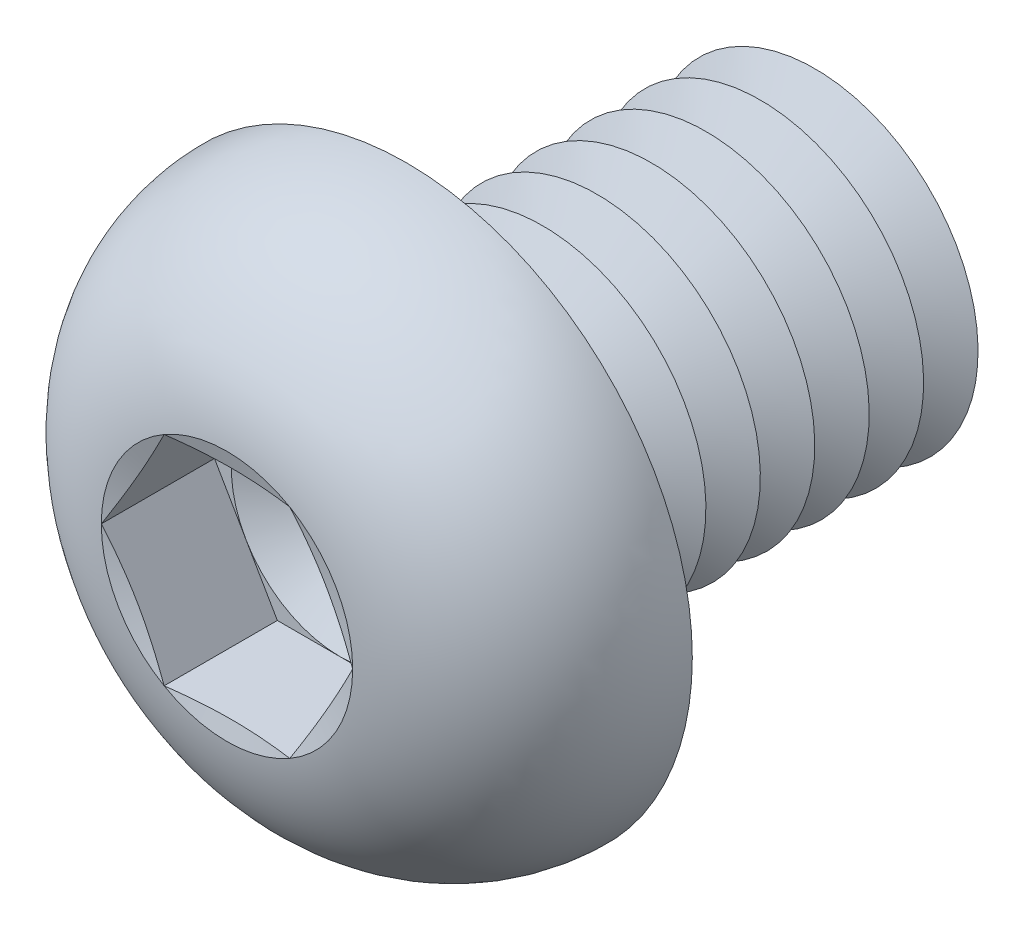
ISO-10303-21;
HEADER;
FILE_DESCRIPTION(('STEP AP214'),'2;1');
FILE_NAME('part.step','',(''),(''),'','','');
FILE_SCHEMA(('AUTOMOTIVE_DESIGN { 1 0 10303 214 1 1 1 1 }'));
ENDSEC;
DATA;
#1=APPLICATION_CONTEXT('core data for automotive mechanical design processes');
#2=APPLICATION_PROTOCOL_DEFINITION('international standard','automotive_design',2000,#1);
#3=PRODUCT_CONTEXT('',#1,'mechanical');
#4=PRODUCT('Part','Part','',(#3));
#5=PRODUCT_RELATED_PRODUCT_CATEGORY('part','',(#4));
#6=PRODUCT_DEFINITION_FORMATION('','',#4);
#7=PRODUCT_DEFINITION_CONTEXT('part definition',#1,'design');
#8=PRODUCT_DEFINITION('design','',#6,#7);
#9=PRODUCT_DEFINITION_SHAPE('','',#8);
#10=(LENGTH_UNIT() NAMED_UNIT(*) SI_UNIT(.MILLI.,.METRE.));
#11=(NAMED_UNIT(*) PLANE_ANGLE_UNIT() SI_UNIT($,.RADIAN.));
#12=(NAMED_UNIT(*) SI_UNIT($,.STERADIAN.) SOLID_ANGLE_UNIT());
#13=UNCERTAINTY_MEASURE_WITH_UNIT(LENGTH_MEASURE(1.E-05),#10,'distance_accuracy_value','');
#14=(GEOMETRIC_REPRESENTATION_CONTEXT(3) GLOBAL_UNCERTAINTY_ASSIGNED_CONTEXT((#13)) GLOBAL_UNIT_ASSIGNED_CONTEXT((#10,
#11,#12)) REPRESENTATION_CONTEXT('',''));
#15=CARTESIAN_POINT('',(0.,0.,0.));
#16=DIRECTION('',(0.,0.,1.));
#17=DIRECTION('',(1.,0.,0.));
#18=AXIS2_PLACEMENT_3D('',#15,#16,#17);
#19=CARTESIAN_POINT('',(0.,0.,1.22));
#20=DIRECTION('',(0.,0.,1.));
#21=DIRECTION('',(1.,0.,0.));
#22=AXIS2_PLACEMENT_3D('',#19,#20,#21);
#23=PLANE('',#22);
#24=CARTESIAN_POINT('',(0.,0.,1.22));
#25=DIRECTION('',(0.,0.,1.));
#26=DIRECTION('',(1.,0.,0.));
#27=AXIS2_PLACEMENT_3D('',#24,#25,#26);
#28=CIRCLE('',#27,1.99999906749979);
#29=CARTESIAN_POINT('',(1.73205,0.999999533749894,1.22));
#30=VERTEX_POINT('',#29);
#31=CARTESIAN_POINT('',(0.,1.99999906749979,1.22));
#32=VERTEX_POINT('',#31);
#33=EDGE_CURVE('E118',#30,#32,#28,.T.);
#34=ORIENTED_EDGE('',*,*,#33,.F.);
#35=DIRECTION('',(-0.5,0.866025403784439,0.));
#36=VECTOR('',#35,1.);
#37=CARTESIAN_POINT('',(2.30940000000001,0.,1.22));
#38=LINE('',#37,#36);
#39=CARTESIAN_POINT('',(1.1547,1.99999906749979,1.22));
#40=VERTEX_POINT('',#39);
#41=EDGE_CURVE('E125',#30,#40,#38,.T.);
#42=ORIENTED_EDGE('',*,*,#41,.T.);
#43=DIRECTION('',(-1.,0.,0.));
#44=VECTOR('',#43,1.);
#45=CARTESIAN_POINT('',(1.1547,1.99999906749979,1.22));
#46=LINE('',#45,#44);
#47=EDGE_CURVE('E136',#40,#32,#46,.T.);
#48=ORIENTED_EDGE('',*,*,#47,.T.);
#49=EDGE_LOOP('',(#34,#42,#48));
#50=FACE_BOUND('',#49,.T.);
#51=ADVANCED_FACE('F39',(#50),#23,.T.);
#52=CARTESIAN_POINT('',(0.,0.,1.22));
#53=DIRECTION('',(0.,0.,1.));
#54=DIRECTION('',(1.,0.,0.));
#55=AXIS2_PLACEMENT_3D('',#52,#53,#54);
#56=CIRCLE('',#55,1.99999906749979);
#57=CARTESIAN_POINT('',(-1.73205,0.999999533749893,1.22));
#58=VERTEX_POINT('',#57);
#59=EDGE_CURVE('E11',#32,#58,#56,.T.);
#60=ORIENTED_EDGE('',*,*,#59,.F.);
#61=CARTESIAN_POINT('',(-1.1547,1.99999906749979,1.22));
#62=VERTEX_POINT('',#61);
#63=EDGE_CURVE('E131',#32,#62,#46,.T.);
#64=ORIENTED_EDGE('',*,*,#63,.T.);
#65=DIRECTION('',(-0.5,-0.866025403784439,0.));
#66=VECTOR('',#65,1.);
#67=CARTESIAN_POINT('',(-1.1547,1.99999906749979,1.22));
#68=LINE('',#67,#66);
#69=EDGE_CURVE('E134',#62,#58,#68,.T.);
#70=ORIENTED_EDGE('',*,*,#69,.T.);
#71=EDGE_LOOP('',(#60,#64,#70));
#72=FACE_BOUND('',#71,.T.);
#73=ADVANCED_FACE('F130',(#72),#23,.T.);
#74=CARTESIAN_POINT('',(-1.73205,-0.999999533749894,1.22));
#75=VERTEX_POINT('',#74);
#76=EDGE_CURVE('E49',#58,#75,#56,.T.);
#77=ORIENTED_EDGE('',*,*,#76,.F.);
#78=CARTESIAN_POINT('',(-2.30940000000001,0.,1.22));
#79=VERTEX_POINT('',#78);
#80=EDGE_CURVE('E143',#58,#79,#68,.T.);
#81=ORIENTED_EDGE('',*,*,#80,.T.);
#82=DIRECTION('',(0.5,-0.866025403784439,0.));
#83=VECTOR('',#82,1.);
#84=CARTESIAN_POINT('',(-2.30940000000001,0.,1.22));
#85=LINE('',#84,#83);
#86=EDGE_CURVE('E152',#79,#75,#85,.T.);
#87=ORIENTED_EDGE('',*,*,#86,.T.);
#88=EDGE_LOOP('',(#77,#81,#87));
#89=FACE_BOUND('',#88,.T.);
#90=ADVANCED_FACE('F332',(#89),#23,.T.);
#91=CARTESIAN_POINT('',(0.,-1.99999906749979,1.22));
#92=VERTEX_POINT('',#91);
#93=EDGE_CURVE('E315',#75,#92,#56,.T.);
#94=ORIENTED_EDGE('',*,*,#93,.F.);
#95=CARTESIAN_POINT('',(-1.1547,-1.99999906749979,1.22));
#96=VERTEX_POINT('',#95);
#97=EDGE_CURVE('E151',#75,#96,#85,.T.);
#98=ORIENTED_EDGE('',*,*,#97,.T.);
#99=DIRECTION('',(1.,0.,0.));
#100=VECTOR('',#99,1.);
#101=CARTESIAN_POINT('',(-1.1547,-1.99999906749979,1.22));
#102=LINE('',#101,#100);
#103=EDGE_CURVE('E157',#96,#92,#102,.T.);
#104=ORIENTED_EDGE('',*,*,#103,.T.);
#105=EDGE_LOOP('',(#94,#98,#104));
#106=FACE_BOUND('',#105,.T.);
#107=ADVANCED_FACE('F326',(#106),#23,.T.);
#108=CARTESIAN_POINT('',(1.73205000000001,-0.999999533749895,1.22));
#109=VERTEX_POINT('',#108);
#110=EDGE_CURVE('E56',#92,#109,#56,.T.);
#111=ORIENTED_EDGE('',*,*,#110,.F.);
#112=CARTESIAN_POINT('',(1.1547,-1.99999906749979,1.22));
#113=VERTEX_POINT('',#112);
#114=EDGE_CURVE('E156',#92,#113,#102,.T.);
#115=ORIENTED_EDGE('',*,*,#114,.T.);
#116=DIRECTION('',(0.5,0.866025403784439,0.));
#117=VECTOR('',#116,1.);
#118=CARTESIAN_POINT('',(1.1547,-1.99999906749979,1.22));
#119=LINE('',#118,#117);
#120=EDGE_CURVE('E162',#113,#109,#119,.T.);
#121=ORIENTED_EDGE('',*,*,#120,.T.);
#122=EDGE_LOOP('',(#111,#115,#121));
#123=FACE_BOUND('',#122,.T.);
#124=ADVANCED_FACE('F400',(#123),#23,.T.);
#125=CARTESIAN_POINT('',(0.,0.,3.3));
#126=DIRECTION('',(0.,0.,1.));
#127=DIRECTION('',(0.,-1.,0.));
#128=AXIS2_PLACEMENT_3D('',#125,#126,#127);
#129=CONICAL_SURFACE('',#128,2.30940000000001,1.30899693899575);
#130=CARTESIAN_POINT('',(2.30951547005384,-0.000200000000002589,3.30003094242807));
#131=CARTESIAN_POINT('',(2.26155412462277,0.0828714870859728,3.2871729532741));
#132=CARTESIAN_POINT('',(2.2135058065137,0.166093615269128,3.27549992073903));
#133=CARTESIAN_POINT('',(2.11723944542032,0.332831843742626,3.2549913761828));
#134=CARTESIAN_POINT('',(2.06902134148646,0.416348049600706,3.24615701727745));
#135=CARTESIAN_POINT('',(1.97270782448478,0.583167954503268,3.23184167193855));
#136=CARTESIAN_POINT('',(1.92461306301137,0.666470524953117,3.22634360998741));
#137=CARTESIAN_POINT('',(1.82836219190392,0.833181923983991,3.21897125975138));
#138=CARTESIAN_POINT('',(1.78020609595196,0.916590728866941,3.21709626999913));
#139=CARTESIAN_POINT('',(1.68389390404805,1.08340833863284,3.21709626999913));
#140=CARTESIAN_POINT('',(1.63573780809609,1.16681714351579,3.21897125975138));
#141=CARTESIAN_POINT('',(1.53948693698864,1.33352854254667,3.22634360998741));
#142=CARTESIAN_POINT('',(1.49139217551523,1.41683111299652,3.23184167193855));
#143=CARTESIAN_POINT('',(1.39507865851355,1.58365101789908,3.24615701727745));
#144=CARTESIAN_POINT('',(1.34686055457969,1.66716722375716,3.2549913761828));
#145=CARTESIAN_POINT('',(1.25059419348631,1.83390545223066,3.27549992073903));
#146=CARTESIAN_POINT('',(1.20254587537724,1.91712758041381,3.2871729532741));
#147=CARTESIAN_POINT('',(1.15458452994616,2.00019906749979,3.30003094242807));
#148=B_SPLINE_CURVE_WITH_KNOTS('',3,(#130,#131,#132,#133,#134,#135,#136,#137,#138,#139,#140,
#141,#142,#143,#144,#145,#146,#147),.UNSPECIFIED.,.F.,.F.,(4,2,2,2,2,2,2,2,4),(0.,
0.29035711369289,0.580832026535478,0.86980743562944,1.15872689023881,1.44764634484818,
1.73662175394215,2.02709666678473,2.31745378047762),.UNSPECIFIED.);
#149=CARTESIAN_POINT('',(2.30940000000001,0.,3.3));
#150=VERTEX_POINT('',#149);
#151=CARTESIAN_POINT('',(1.15469999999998,1.9999990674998,3.3));
#152=VERTEX_POINT('',#151);
#153=EDGE_CURVE('E221',#150,#152,#148,.T.);
#154=ORIENTED_EDGE('',*,*,#153,.F.);
#155=CARTESIAN_POINT('',(0.,0.,3.3));
#156=DIRECTION('',(0.,0.,-1.));
#157=DIRECTION('',(0.,1.,0.));
#158=AXIS2_PLACEMENT_3D('',#155,#156,#157);
#159=CIRCLE('',#158,2.30940000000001);
#160=EDGE_CURVE('E300',#152,#150,#159,.T.);
#161=ORIENTED_EDGE('',*,*,#160,.F.);
#162=EDGE_LOOP('',(#154,#161));
#163=FACE_BOUND('',#162,.T.);
#164=ADVANCED_FACE('F404',(#163),#129,.F.);
#165=CARTESIAN_POINT('',(1.15458452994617,-2.00019906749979,3.30003094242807));
#166=CARTESIAN_POINT('',(1.20254587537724,-1.91712758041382,3.2871729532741));
#167=CARTESIAN_POINT('',(1.25059419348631,-1.83390545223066,3.27549992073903));
#168=CARTESIAN_POINT('',(1.34686055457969,-1.66716722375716,3.2549913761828));
#169=CARTESIAN_POINT('',(1.39507865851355,-1.58365101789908,3.24615701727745));
#170=CARTESIAN_POINT('',(1.49139217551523,-1.41683111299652,3.23184167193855));
#171=CARTESIAN_POINT('',(1.53948693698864,-1.33352854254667,3.22634360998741));
#172=CARTESIAN_POINT('',(1.63573780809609,-1.1668171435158,3.21897125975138));
#173=CARTESIAN_POINT('',(1.68389390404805,-1.08340833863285,3.21709626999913));
#174=CARTESIAN_POINT('',(1.78020609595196,-0.916590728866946,3.21709626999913));
#175=CARTESIAN_POINT('',(1.82836219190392,-0.833181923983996,3.21897125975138));
#176=CARTESIAN_POINT('',(1.92461306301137,-0.666470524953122,3.22634360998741));
#177=CARTESIAN_POINT('',(1.97270782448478,-0.583167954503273,3.23184167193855));
#178=CARTESIAN_POINT('',(2.06902134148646,-0.416348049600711,3.24615701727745));
#179=CARTESIAN_POINT('',(2.11723944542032,-0.332831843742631,3.2549913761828));
#180=CARTESIAN_POINT('',(2.2135058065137,-0.166093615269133,3.27549992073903));
#181=CARTESIAN_POINT('',(2.26155412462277,-0.0828714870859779,3.2871729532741));
#182=CARTESIAN_POINT('',(2.30951547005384,0.000199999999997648,3.30003094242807));
#183=B_SPLINE_CURVE_WITH_KNOTS('',3,(#165,#166,#167,#168,#169,#170,#171,#172,#173,#174,#175,
#176,#177,#178,#179,#180,#181,#182),.UNSPECIFIED.,.F.,.F.,(4,2,2,2,2,2,2,2,4),(0.,
0.29035711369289,0.580832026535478,0.86980743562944,1.15872689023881,1.44764634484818,
1.73662175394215,2.02709666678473,2.31745378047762),.UNSPECIFIED.);
#184=CARTESIAN_POINT('',(1.1547,-1.99999906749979,3.3));
#185=VERTEX_POINT('',#184);
#186=EDGE_CURVE('E230',#185,#150,#183,.T.);
#187=ORIENTED_EDGE('',*,*,#186,.F.);
#188=EDGE_CURVE('E304',#150,#185,#159,.T.);
#189=ORIENTED_EDGE('',*,*,#188,.F.);
#190=EDGE_LOOP('',(#187,#189));
#191=FACE_BOUND('',#190,.T.);
#192=ADVANCED_FACE('F366',(#191),#129,.F.);
#193=CARTESIAN_POINT('',(-3.48493375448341,-1.99999906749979,3.75783251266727));
#194=CARTESIAN_POINT('',(-3.40057136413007,-1.99999906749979,3.7382285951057));
#195=CARTESIAN_POINT('',(-3.31617090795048,-1.99999906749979,3.71878852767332));
#196=CARTESIAN_POINT('',(-3.14727791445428,-1.99999906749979,3.68030638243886));
#197=CARTESIAN_POINT('',(-3.06278537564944,-1.99999906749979,3.66126431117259));
#198=CARTESIAN_POINT('',(-2.80911712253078,-1.99999906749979,3.60483420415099));
#199=CARTESIAN_POINT('',(-2.63978343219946,-1.99999906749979,3.5681499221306));
#200=CARTESIAN_POINT('',(-2.2989542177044,-1.99999906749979,3.49717072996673));
#201=CARTESIAN_POINT('',(-2.12745330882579,-1.99999906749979,3.4629014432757));
#202=CARTESIAN_POINT('',(-1.7836466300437,-1.99999906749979,3.39849485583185));
#203=CARTESIAN_POINT('',(-1.61134079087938,-1.99999906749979,3.36835791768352));
#204=CARTESIAN_POINT('',(-1.27040784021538,-1.99999906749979,3.31501553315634));
#205=CARTESIAN_POINT('',(-1.10180724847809,-1.99999906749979,3.291644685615));
#206=CARTESIAN_POINT('',(-0.763641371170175,-1.99999906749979,3.2533727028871));
#207=CARTESIAN_POINT('',(-0.594076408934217,-1.99999906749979,3.23846888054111));
#208=CARTESIAN_POINT('',(-0.339649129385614,-1.99999906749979,3.22431372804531));
#209=CARTESIAN_POINT('',(-0.255009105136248,-1.99999906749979,3.22096057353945));
#210=CARTESIAN_POINT('',(-0.0856618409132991,-1.99999906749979,3.21711210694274));
#211=CARTESIAN_POINT('',(-0.000954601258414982,-1.99999906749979,3.2166167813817));
#212=CARTESIAN_POINT('',(0.168430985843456,-1.99999906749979,3.21851478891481));
#213=CARTESIAN_POINT('',(0.253109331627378,-1.99999906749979,3.2209082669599));
#214=CARTESIAN_POINT('',(0.422344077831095,-1.99999906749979,3.22845792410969));
#215=CARTESIAN_POINT('',(0.506900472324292,-1.99999906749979,3.23361423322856));
#216=CARTESIAN_POINT('',(0.712240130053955,-1.99999906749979,3.24921577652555));
#217=CARTESIAN_POINT('',(0.832922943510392,-1.99999906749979,3.26098285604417));
#218=CARTESIAN_POINT('',(1.07378161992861,-1.99999906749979,3.28874908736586));
#219=CARTESIAN_POINT('',(1.1939575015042,-1.99999906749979,3.30474808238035));
#220=CARTESIAN_POINT('',(1.43419655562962,-1.99999906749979,3.34009172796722));
#221=CARTESIAN_POINT('',(1.55425817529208,-1.99999906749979,3.35944677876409));
#222=CARTESIAN_POINT('',(1.79394991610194,-1.99999906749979,3.40067076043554));
#223=CARTESIAN_POINT('',(1.91358001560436,-1.99999906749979,3.42253981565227));
#224=CARTESIAN_POINT('',(2.15493405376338,-1.99999906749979,3.46864194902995));
#225=CARTESIAN_POINT('',(2.27665041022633,-1.99999906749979,3.49291441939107));
#226=CARTESIAN_POINT('',(2.51977680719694,-1.99999906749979,3.54294628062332));
#227=CARTESIAN_POINT('',(2.64118684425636,-1.99999906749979,3.56870568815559));
#228=CARTESIAN_POINT('',(2.8831006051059,-1.99999906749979,3.6212089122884));
#229=CARTESIAN_POINT('',(3.00360566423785,-1.99999906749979,3.6479466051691));
#230=CARTESIAN_POINT('',(3.24441021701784,-1.99999906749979,3.7022947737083));
#231=CARTESIAN_POINT('',(3.36470972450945,-1.99999906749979,3.72990518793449));
#232=CARTESIAN_POINT('',(3.48493375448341,-1.99999906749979,3.75783251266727));
#233=B_SPLINE_CURVE_WITH_KNOTS('',3,(#193,#194,#195,#196,#197,#198,#199,#200,#201,#202,#203,
#204,#205,#206,#207,#208,#209,#210,#211,#212,#213,#214,#215,#216,#217,#218,#219,#220,#221,#222,
#223,#224,#225,#226,#227,#228,#229,#230,#231,#232),.UNSPECIFIED.,.F.,.F.,(4,2,2,2,2,2,2,2,2,2,2,
2,2,2,2,2,2,2,2,4),(0.,0.259830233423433,0.519664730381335,1.03943435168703,1.56407662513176,
2.08876490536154,2.59926476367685,3.10960251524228,3.36367930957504,3.61775490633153,
3.87184325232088,4.12594355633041,4.48960924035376,4.85326145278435,5.21806142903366,
5.58287945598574,5.9552061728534,6.32753706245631,6.69784064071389,7.06811821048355),.UNSPECIFIED.);
#234=CARTESIAN_POINT('',(-1.1547,-1.99999906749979,3.3));
#235=VERTEX_POINT('',#234);
#236=EDGE_CURVE('E346',#235,#185,#233,.T.);
#237=ORIENTED_EDGE('',*,*,#236,.F.);
#238=EDGE_CURVE('E359',#185,#235,#159,.T.);
#239=ORIENTED_EDGE('',*,*,#238,.F.);
#240=EDGE_LOOP('',(#237,#239));
#241=FACE_BOUND('',#240,.T.);
#242=ADVANCED_FACE('F372',(#241),#129,.F.);
#243=CARTESIAN_POINT('',(-2.30951547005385,0.000199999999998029,3.30003094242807));
#244=CARTESIAN_POINT('',(-2.26155412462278,-0.0828714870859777,3.2871729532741));
#245=CARTESIAN_POINT('',(-2.2135058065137,-0.166093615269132,3.27549992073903));
#246=CARTESIAN_POINT('',(-2.11723944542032,-0.332831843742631,3.2549913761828));
#247=CARTESIAN_POINT('',(-2.06902134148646,-0.41634804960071,3.24615701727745));
#248=CARTESIAN_POINT('',(-1.97270782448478,-0.583167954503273,3.23184167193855));
#249=CARTESIAN_POINT('',(-1.92461306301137,-0.666470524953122,3.22634360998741));
#250=CARTESIAN_POINT('',(-1.82836219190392,-0.833181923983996,3.21897125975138));
#251=CARTESIAN_POINT('',(-1.78020609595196,-0.916590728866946,3.21709626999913));
#252=CARTESIAN_POINT('',(-1.68389390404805,-1.08340833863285,3.21709626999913));
#253=CARTESIAN_POINT('',(-1.63573780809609,-1.1668171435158,3.21897125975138));
#254=CARTESIAN_POINT('',(-1.53948693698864,-1.33352854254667,3.22634360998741));
#255=CARTESIAN_POINT('',(-1.49139217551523,-1.41683111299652,3.23184167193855));
#256=CARTESIAN_POINT('',(-1.39507865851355,-1.58365101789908,3.24615701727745));
#257=CARTESIAN_POINT('',(-1.34686055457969,-1.66716722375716,3.2549913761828));
#258=CARTESIAN_POINT('',(-1.25059419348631,-1.83390545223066,3.27549992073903));
#259=CARTESIAN_POINT('',(-1.20254587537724,-1.91712758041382,3.2871729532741));
#260=CARTESIAN_POINT('',(-1.15458452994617,-2.00019906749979,3.30003094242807));
#261=B_SPLINE_CURVE_WITH_KNOTS('',3,(#243,#244,#245,#246,#247,#248,#249,#250,#251,#252,#253,
#254,#255,#256,#257,#258,#259,#260),.UNSPECIFIED.,.F.,.F.,(4,2,2,2,2,2,2,2,4),(0.,
0.29035711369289,0.580832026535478,0.869807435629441,1.15872689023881,1.44764634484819,
1.73662175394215,2.02709666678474,2.31745378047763),.UNSPECIFIED.);
#262=CARTESIAN_POINT('',(-2.30940000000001,0.,3.3));
#263=VERTEX_POINT('',#262);
#264=EDGE_CURVE('E337',#263,#235,#261,.T.);
#265=ORIENTED_EDGE('',*,*,#264,.F.);
#266=EDGE_CURVE('E343',#235,#263,#159,.T.);
#267=ORIENTED_EDGE('',*,*,#266,.F.);
#268=EDGE_LOOP('',(#265,#267));
#269=FACE_BOUND('',#268,.T.);
#270=ADVANCED_FACE('F341',(#269),#129,.F.);
#271=CARTESIAN_POINT('',(-1.15458452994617,2.00019906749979,3.30003094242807));
#272=CARTESIAN_POINT('',(-1.20254587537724,1.91712758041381,3.2871729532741));
#273=CARTESIAN_POINT('',(-1.25059419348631,1.83390545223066,3.27549992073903));
#274=CARTESIAN_POINT('',(-1.34686055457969,1.66716722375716,3.2549913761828));
#275=CARTESIAN_POINT('',(-1.39507865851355,1.58365101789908,3.24615701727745));
#276=CARTESIAN_POINT('',(-1.49139217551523,1.41683111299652,3.23184167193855));
#277=CARTESIAN_POINT('',(-1.53948693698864,1.33352854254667,3.22634360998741));
#278=CARTESIAN_POINT('',(-1.63573780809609,1.16681714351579,3.21897125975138));
#279=CARTESIAN_POINT('',(-1.68389390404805,1.08340833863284,3.21709626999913));
#280=CARTESIAN_POINT('',(-1.78020609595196,0.916590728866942,3.21709626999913));
#281=CARTESIAN_POINT('',(-1.82836219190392,0.833181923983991,3.21897125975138));
#282=CARTESIAN_POINT('',(-1.92461306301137,0.666470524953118,3.22634360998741));
#283=CARTESIAN_POINT('',(-1.97270782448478,0.583167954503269,3.23184167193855));
#284=CARTESIAN_POINT('',(-2.06902134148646,0.416348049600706,3.24615701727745));
#285=CARTESIAN_POINT('',(-2.11723944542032,0.332831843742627,3.2549913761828));
#286=CARTESIAN_POINT('',(-2.2135058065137,0.166093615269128,3.27549992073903));
#287=CARTESIAN_POINT('',(-2.26155412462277,0.0828714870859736,3.2871729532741));
#288=CARTESIAN_POINT('',(-2.30951547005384,-0.000200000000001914,3.30003094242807));
#289=B_SPLINE_CURVE_WITH_KNOTS('',3,(#271,#272,#273,#274,#275,#276,#277,#278,#279,#280,#281,
#282,#283,#284,#285,#286,#287,#288),.UNSPECIFIED.,.F.,.F.,(4,2,2,2,2,2,2,2,4),(0.,
0.29035711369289,0.580832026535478,0.86980743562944,1.15872689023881,1.44764634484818,
1.73662175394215,2.02709666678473,2.31745378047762),.UNSPECIFIED.);
#290=CARTESIAN_POINT('',(-1.1547,1.99999906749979,3.3));
#291=VERTEX_POINT('',#290);
#292=EDGE_CURVE('E195',#291,#263,#289,.T.);
#293=ORIENTED_EDGE('',*,*,#292,.F.);
#294=EDGE_CURVE('E349',#263,#291,#159,.T.);
#295=ORIENTED_EDGE('',*,*,#294,.F.);
#296=EDGE_LOOP('',(#293,#295));
#297=FACE_BOUND('',#296,.T.);
#298=ADVANCED_FACE('F350',(#297),#129,.F.);
#299=CARTESIAN_POINT('',(0.,0.,-4.49999999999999));
#300=DIRECTION('',(0.,0.,1.));
#301=DIRECTION('',(0.,-1.,0.));
#302=AXIS2_PLACEMENT_3D('',#299,#300,#301);
#303=CONICAL_SURFACE('',#302,2.99999999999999,1.0471975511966);
#304=CARTESIAN_POINT('',(0.,0.,-4.99999999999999));
#305=DIRECTION('',(0.,0.,1.));
#306=DIRECTION('',(0.,-1.,0.));
#307=AXIS2_PLACEMENT_3D('',#304,#305,#306);
#308=CIRCLE('',#307,2.13397459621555);
#309=CARTESIAN_POINT('',(0.,-2.13397459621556,-4.99999999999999));
#310=VERTEX_POINT('',#309);
#311=EDGE_CURVE('E272',#310,#310,#308,.T.);
#312=ORIENTED_EDGE('',*,*,#311,.T.);
#313=EDGE_LOOP('',(#312));
#314=FACE_BOUND('',#313,.T.);
#315=CARTESIAN_POINT('',(0.,0.,-4.5));
#316=DIRECTION('',(0.,0.,1.));
#317=DIRECTION('',(0.,-1.,0.));
#318=AXIS2_PLACEMENT_3D('',#315,#316,#317);
#319=CIRCLE('',#318,2.99999999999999);
#320=CARTESIAN_POINT('',(0.,-3.,-4.5));
#321=VERTEX_POINT('',#320);
#322=EDGE_CURVE('E268',#321,#321,#319,.T.);
#323=ORIENTED_EDGE('',*,*,#322,.F.);
#324=EDGE_LOOP('',(#323));
#325=FACE_BOUND('',#324,.T.);
#326=ADVANCED_FACE('F428',(#314,#325),#303,.T.);
#327=CARTESIAN_POINT('',(0.,0.,-4.99999999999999));
#328=DIRECTION('',(0.,0.,-1.));
#329=DIRECTION('',(0.,1.,0.));
#330=AXIS2_PLACEMENT_3D('',#327,#328,#329);
#331=CONICAL_SURFACE('',#330,2.13397459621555,1.0471975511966);
#332=CARTESIAN_POINT('',(0.,0.,-5.5));
#333=DIRECTION('',(0.,0.,1.));
#334=DIRECTION('',(0.,-1.,0.));
#335=AXIS2_PLACEMENT_3D('',#332,#333,#334);
#336=CIRCLE('',#335,2.99999999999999);
#337=CARTESIAN_POINT('',(0.,-3.,-5.5));
#338=VERTEX_POINT('',#337);
#339=EDGE_CURVE('E276',#338,#338,#336,.T.);
#340=ORIENTED_EDGE('',*,*,#339,.T.);
#341=EDGE_LOOP('',(#340));
#342=FACE_BOUND('',#341,.T.);
#343=ORIENTED_EDGE('',*,*,#311,.F.);
#344=EDGE_LOOP('',(#343));
#345=FACE_BOUND('',#344,.T.);
#346=ADVANCED_FACE('F433',(#342,#345),#331,.T.);
#347=CARTESIAN_POINT('',(0.,2.99999999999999,-7.99999999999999));
#348=DIRECTION('',(0.,0.,-1.));
#349=DIRECTION('',(0.,1.,0.));
#350=AXIS2_PLACEMENT_3D('',#347,#348,#349);
#351=PLANE('',#350);
#352=CARTESIAN_POINT('',(0.,0.,-7.99999999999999));
#353=DIRECTION('',(0.,0.,1.));
#354=DIRECTION('',(0.,-1.,0.));
#355=AXIS2_PLACEMENT_3D('',#352,#353,#354);
#356=CIRCLE('',#355,2.13397459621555);
#357=CARTESIAN_POINT('',(0.,-2.13397459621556,-7.99999999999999));
#358=VERTEX_POINT('',#357);
#359=EDGE_CURVE('E296',#358,#358,#356,.T.);
#360=ORIENTED_EDGE('',*,*,#359,.F.);
#361=EDGE_LOOP('',(#360));
#362=FACE_BOUND('',#361,.T.);
#363=ADVANCED_FACE('F600',(#362),#351,.T.);
#364=CARTESIAN_POINT('',(0.,0.,-7.49999999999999));
#365=DIRECTION('',(0.,0.,1.));
#366=DIRECTION('',(0.,-1.,0.));
#367=AXIS2_PLACEMENT_3D('',#364,#365,#366);
#368=CONICAL_SURFACE('',#367,2.99999999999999,1.0471975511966);
#369=ORIENTED_EDGE('',*,*,#359,.T.);
#370=EDGE_LOOP('',(#369));
#371=FACE_BOUND('',#370,.T.);
#372=CARTESIAN_POINT('',(0.,0.,-7.5));
#373=DIRECTION('',(0.,0.,1.));
#374=DIRECTION('',(0.,-1.,0.));
#375=AXIS2_PLACEMENT_3D('',#372,#373,#374);
#376=CIRCLE('',#375,2.99999999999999);
#377=CARTESIAN_POINT('',(0.,-3.,-7.5));
#378=VERTEX_POINT('',#377);
#379=EDGE_CURVE('E292',#378,#378,#376,.T.);
#380=ORIENTED_EDGE('',*,*,#379,.F.);
#381=EDGE_LOOP('',(#380));
#382=FACE_BOUND('',#381,.T.);
#383=ADVANCED_FACE('F593',(#371,#382),#368,.T.);
#384=CARTESIAN_POINT('',(0.,0.,-6.99999999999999));
#385=DIRECTION('',(0.,0.,-1.));
#386=DIRECTION('',(0.,1.,0.));
#387=AXIS2_PLACEMENT_3D('',#384,#385,#386);
#388=CONICAL_SURFACE('',#387,2.13397459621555,1.0471975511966);
#389=ORIENTED_EDGE('',*,*,#379,.T.);
#390=EDGE_LOOP('',(#389));
#391=FACE_BOUND('',#390,.T.);
#392=CARTESIAN_POINT('',(0.,0.,-6.99999999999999));
#393=DIRECTION('',(0.,0.,1.));
#394=DIRECTION('',(0.,-1.,0.));
#395=AXIS2_PLACEMENT_3D('',#392,#393,#394);
#396=CIRCLE('',#395,2.13397459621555);
#397=CARTESIAN_POINT('',(0.,-2.13397459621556,-6.99999999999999));
#398=VERTEX_POINT('',#397);
#399=EDGE_CURVE('E288',#398,#398,#396,.T.);
#400=ORIENTED_EDGE('',*,*,#399,.F.);
#401=EDGE_LOOP('',(#400));
#402=FACE_BOUND('',#401,.T.);
#403=ADVANCED_FACE('F599',(#391,#402),#388,.T.);
#404=CARTESIAN_POINT('',(0.,0.,-6.49999999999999));
#405=DIRECTION('',(0.,0.,1.));
#406=DIRECTION('',(0.,-1.,0.));
#407=AXIS2_PLACEMENT_3D('',#404,#405,#406);
#408=CONICAL_SURFACE('',#407,2.99999999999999,1.0471975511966);
#409=ORIENTED_EDGE('',*,*,#399,.T.);
#410=EDGE_LOOP('',(#409));
#411=FACE_BOUND('',#410,.T.);
#412=CARTESIAN_POINT('',(0.,0.,-6.5));
#413=DIRECTION('',(0.,0.,1.));
#414=DIRECTION('',(0.,-1.,0.));
#415=AXIS2_PLACEMENT_3D('',#412,#413,#414);
#416=CIRCLE('',#415,2.99999999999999);
#417=CARTESIAN_POINT('',(0.,-3.,-6.5));
#418=VERTEX_POINT('',#417);
#419=EDGE_CURVE('E284',#418,#418,#416,.T.);
#420=ORIENTED_EDGE('',*,*,#419,.F.);
#421=EDGE_LOOP('',(#420));
#422=FACE_BOUND('',#421,.T.);
#423=ADVANCED_FACE('F631',(#411,#422),#408,.T.);
#424=CARTESIAN_POINT('',(0.,0.,-5.99999999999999));
#425=DIRECTION('',(0.,0.,-1.));
#426=DIRECTION('',(0.,1.,0.));
#427=AXIS2_PLACEMENT_3D('',#424,#425,#426);
#428=CONICAL_SURFACE('',#427,2.13397459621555,1.0471975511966);
#429=ORIENTED_EDGE('',*,*,#419,.T.);
#430=EDGE_LOOP('',(#429));
#431=FACE_BOUND('',#430,.T.);
#432=CARTESIAN_POINT('',(0.,0.,-5.99999999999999));
#433=DIRECTION('',(0.,0.,1.));
#434=DIRECTION('',(0.,-1.,0.));
#435=AXIS2_PLACEMENT_3D('',#432,#433,#434);
#436=CIRCLE('',#435,2.13397459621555);
#437=CARTESIAN_POINT('',(0.,-2.13397459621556,-5.99999999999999));
#438=VERTEX_POINT('',#437);
#439=EDGE_CURVE('E280',#438,#438,#436,.T.);
#440=ORIENTED_EDGE('',*,*,#439,.F.);
#441=EDGE_LOOP('',(#440));
#442=FACE_BOUND('',#441,.T.);
#443=ADVANCED_FACE('F641',(#431,#442),#428,.T.);
#444=CARTESIAN_POINT('',(0.,0.,-5.49999999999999));
#445=DIRECTION('',(0.,0.,1.));
#446=DIRECTION('',(0.,-1.,0.));
#447=AXIS2_PLACEMENT_3D('',#444,#445,#446);
#448=CONICAL_SURFACE('',#447,2.99999999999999,1.0471975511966);
#449=ORIENTED_EDGE('',*,*,#439,.T.);
#450=EDGE_LOOP('',(#449));
#451=FACE_BOUND('',#450,.T.);
#452=ORIENTED_EDGE('',*,*,#339,.F.);
#453=EDGE_LOOP('',(#452));
#454=FACE_BOUND('',#453,.T.);
#455=ADVANCED_FACE('F651',(#451,#454),#448,.T.);
#456=CARTESIAN_POINT('',(0.,0.,-3.49999999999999));
#457=DIRECTION('',(0.,0.,1.));
#458=DIRECTION('',(0.,-1.,0.));
#459=AXIS2_PLACEMENT_3D('',#456,#457,#458);
#460=CONICAL_SURFACE('',#459,2.99999999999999,1.0471975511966);
#461=CARTESIAN_POINT('',(0.,0.,-3.99999999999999));
#462=DIRECTION('',(0.,0.,1.));
#463=DIRECTION('',(0.,-1.,0.));
#464=AXIS2_PLACEMENT_3D('',#461,#462,#463);
#465=CIRCLE('',#464,2.13397459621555);
#466=CARTESIAN_POINT('',(0.,-2.13397459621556,-3.99999999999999));
#467=VERTEX_POINT('',#466);
#468=EDGE_CURVE('E264',#467,#467,#465,.T.);
#469=ORIENTED_EDGE('',*,*,#468,.T.);
#470=EDGE_LOOP('',(#469));
#471=FACE_BOUND('',#470,.T.);
#472=CARTESIAN_POINT('',(0.,0.,-3.5));
#473=DIRECTION('',(0.,0.,1.));
#474=DIRECTION('',(0.,-1.,0.));
#475=AXIS2_PLACEMENT_3D('',#472,#473,#474);
#476=CIRCLE('',#475,2.99999999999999);
#477=CARTESIAN_POINT('',(0.,-3.,-3.5));
#478=VERTEX_POINT('',#477);
#479=EDGE_CURVE('E260',#478,#478,#476,.T.);
#480=ORIENTED_EDGE('',*,*,#479,.F.);
#481=EDGE_LOOP('',(#480));
#482=FACE_BOUND('',#481,.T.);
#483=ADVANCED_FACE('F661',(#471,#482),#460,.T.);
#484=CARTESIAN_POINT('',(0.,0.,-3.99999999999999));
#485=DIRECTION('',(0.,0.,-1.));
#486=DIRECTION('',(0.,1.,0.));
#487=AXIS2_PLACEMENT_3D('',#484,#485,#486);
#488=CONICAL_SURFACE('',#487,2.13397459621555,1.0471975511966);
#489=ORIENTED_EDGE('',*,*,#322,.T.);
#490=EDGE_LOOP('',(#489));
#491=FACE_BOUND('',#490,.T.);
#492=ORIENTED_EDGE('',*,*,#468,.F.);
#493=EDGE_LOOP('',(#492));
#494=FACE_BOUND('',#493,.T.);
#495=ADVANCED_FACE('F671',(#491,#494),#488,.T.);
#496=CARTESIAN_POINT('',(0.,0.,-2.49999999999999));
#497=DIRECTION('',(0.,0.,1.));
#498=DIRECTION('',(0.,-1.,0.));
#499=AXIS2_PLACEMENT_3D('',#496,#497,#498);
#500=CONICAL_SURFACE('',#499,2.99999999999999,1.0471975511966);
#501=CARTESIAN_POINT('',(0.,0.,-2.99999999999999));
#502=DIRECTION('',(0.,0.,1.));
#503=DIRECTION('',(0.,-1.,0.));
#504=AXIS2_PLACEMENT_3D('',#501,#502,#503);
#505=CIRCLE('',#504,2.13397459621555);
#506=CARTESIAN_POINT('',(0.,-2.13397459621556,-2.99999999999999));
#507=VERTEX_POINT('',#506);
#508=EDGE_CURVE('E256',#507,#507,#505,.T.);
#509=ORIENTED_EDGE('',*,*,#508,.T.);
#510=EDGE_LOOP('',(#509));
#511=FACE_BOUND('',#510,.T.);
#512=CARTESIAN_POINT('',(0.,0.,-2.5));
#513=DIRECTION('',(0.,0.,1.));
#514=DIRECTION('',(0.,-1.,0.));
#515=AXIS2_PLACEMENT_3D('',#512,#513,#514);
#516=CIRCLE('',#515,2.99999999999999);
#517=CARTESIAN_POINT('',(0.,-3.,-2.5));
#518=VERTEX_POINT('',#517);
#519=EDGE_CURVE('E252',#518,#518,#516,.T.);
#520=ORIENTED_EDGE('',*,*,#519,.F.);
#521=EDGE_LOOP('',(#520));
#522=FACE_BOUND('',#521,.T.);
#523=ADVANCED_FACE('F681',(#511,#522),#500,.T.);
#524=CARTESIAN_POINT('',(0.,0.,-2.99999999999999));
#525=DIRECTION('',(0.,0.,-1.));
#526=DIRECTION('',(0.,1.,0.));
#527=AXIS2_PLACEMENT_3D('',#524,#525,#526);
#528=CONICAL_SURFACE('',#527,2.13397459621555,1.0471975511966);
#529=ORIENTED_EDGE('',*,*,#479,.T.);
#530=EDGE_LOOP('',(#529));
#531=FACE_BOUND('',#530,.T.);
#532=ORIENTED_EDGE('',*,*,#508,.F.);
#533=EDGE_LOOP('',(#532));
#534=FACE_BOUND('',#533,.T.);
#535=ADVANCED_FACE('F691',(#531,#534),#528,.T.);
#536=CARTESIAN_POINT('',(0.,0.,-1.49999999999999));
#537=DIRECTION('',(0.,0.,1.));
#538=DIRECTION('',(0.,-1.,0.));
#539=AXIS2_PLACEMENT_3D('',#536,#537,#538);
#540=CONICAL_SURFACE('',#539,2.99999999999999,1.0471975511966);
#541=CARTESIAN_POINT('',(0.,0.,-1.99999999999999));
#542=DIRECTION('',(0.,0.,1.));
#543=DIRECTION('',(0.,-1.,0.));
#544=AXIS2_PLACEMENT_3D('',#541,#542,#543);
#545=CIRCLE('',#544,2.13397459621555);
#546=CARTESIAN_POINT('',(0.,-2.13397459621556,-1.99999999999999));
#547=VERTEX_POINT('',#546);
#548=EDGE_CURVE('E248',#547,#547,#545,.T.);
#549=ORIENTED_EDGE('',*,*,#548,.T.);
#550=EDGE_LOOP('',(#549));
#551=FACE_BOUND('',#550,.T.);
#552=CARTESIAN_POINT('',(0.,0.,-1.5));
#553=DIRECTION('',(0.,0.,1.));
#554=DIRECTION('',(0.,-1.,0.));
#555=AXIS2_PLACEMENT_3D('',#552,#553,#554);
#556=CIRCLE('',#555,2.99999999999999);
#557=CARTESIAN_POINT('',(0.,-3.,-1.5));
#558=VERTEX_POINT('',#557);
#559=EDGE_CURVE('E240',#558,#558,#556,.T.);
#560=ORIENTED_EDGE('',*,*,#559,.F.);
#561=EDGE_LOOP('',(#560));
#562=FACE_BOUND('',#561,.T.);
#563=ADVANCED_FACE('F701',(#551,#562),#540,.T.);
#564=CARTESIAN_POINT('',(0.,0.,-1.99999999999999));
#565=DIRECTION('',(0.,0.,-1.));
#566=DIRECTION('',(0.,1.,0.));
#567=AXIS2_PLACEMENT_3D('',#564,#565,#566);
#568=CONICAL_SURFACE('',#567,2.13397459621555,1.0471975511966);
#569=ORIENTED_EDGE('',*,*,#519,.T.);
#570=EDGE_LOOP('',(#569));
#571=FACE_BOUND('',#570,.T.);
#572=ORIENTED_EDGE('',*,*,#548,.F.);
#573=EDGE_LOOP('',(#572));
#574=FACE_BOUND('',#573,.T.);
#575=ADVANCED_FACE('F711',(#571,#574),#568,.T.);
#576=CARTESIAN_POINT('',(0.,0.,-0.499999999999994));
#577=DIRECTION('',(0.,0.,1.));
#578=DIRECTION('',(0.,-1.,0.));
#579=AXIS2_PLACEMENT_3D('',#576,#577,#578);
#580=CONICAL_SURFACE('',#579,2.99999999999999,1.0471975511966);
#581=CARTESIAN_POINT('',(0.,0.,-0.999999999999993));
#582=DIRECTION('',(0.,0.,1.));
#583=DIRECTION('',(0.,-1.,0.));
#584=AXIS2_PLACEMENT_3D('',#581,#582,#583);
#585=CIRCLE('',#584,2.13397459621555);
#586=CARTESIAN_POINT('',(0.,-2.13397459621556,-0.999999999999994));
#587=VERTEX_POINT('',#586);
#588=EDGE_CURVE('E229',#587,#587,#585,.T.);
#589=ORIENTED_EDGE('',*,*,#588,.T.);
#590=EDGE_LOOP('',(#589));
#591=FACE_BOUND('',#590,.T.);
#592=CARTESIAN_POINT('',(0.,0.,-0.499999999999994));
#593=DIRECTION('',(0.,0.,1.));
#594=DIRECTION('',(0.,-1.,0.));
#595=AXIS2_PLACEMENT_3D('',#592,#593,#594);
#596=CIRCLE('',#595,2.99999999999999);
#597=CARTESIAN_POINT('',(0.,-3.,-0.499999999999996));
#598=VERTEX_POINT('',#597);
#599=EDGE_CURVE('E244',#598,#598,#596,.T.);
#600=ORIENTED_EDGE('',*,*,#599,.F.);
#601=EDGE_LOOP('',(#600));
#602=FACE_BOUND('',#601,.T.);
#603=ADVANCED_FACE('F425',(#591,#602),#580,.T.);
#604=CARTESIAN_POINT('',(0.,0.,-0.999999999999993));
#605=DIRECTION('',(0.,0.,-1.));
#606=DIRECTION('',(0.,1.,0.));
#607=AXIS2_PLACEMENT_3D('',#604,#605,#606);
#608=CONICAL_SURFACE('',#607,2.13397459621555,1.0471975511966);
#609=ORIENTED_EDGE('',*,*,#559,.T.);
#610=EDGE_LOOP('',(#609));
#611=FACE_BOUND('',#610,.T.);
#612=ORIENTED_EDGE('',*,*,#588,.F.);
#613=EDGE_LOOP('',(#612));
#614=FACE_BOUND('',#613,.T.);
#615=ADVANCED_FACE('F218',(#611,#614),#608,.T.);
#616=CARTESIAN_POINT('',(3.48493375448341,1.99999906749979,3.75783251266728));
#617=CARTESIAN_POINT('',(3.40057136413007,1.99999906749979,3.7382285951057));
#618=CARTESIAN_POINT('',(3.31617090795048,1.99999906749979,3.71878852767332));
#619=CARTESIAN_POINT('',(3.14727791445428,1.99999906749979,3.68030638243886));
#620=CARTESIAN_POINT('',(3.06278537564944,1.99999906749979,3.66126431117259));
#621=CARTESIAN_POINT('',(2.80911712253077,1.99999906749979,3.604834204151));
#622=CARTESIAN_POINT('',(2.63978343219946,1.99999906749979,3.5681499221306));
#623=CARTESIAN_POINT('',(2.2989542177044,1.99999906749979,3.49717072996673));
#624=CARTESIAN_POINT('',(2.12745330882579,1.99999906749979,3.4629014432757));
#625=CARTESIAN_POINT('',(1.78364663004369,1.99999906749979,3.39849485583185));
#626=CARTESIAN_POINT('',(1.61134079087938,1.99999906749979,3.36835791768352));
#627=CARTESIAN_POINT('',(1.27040784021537,1.99999906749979,3.31501553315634));
#628=CARTESIAN_POINT('',(1.10180724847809,1.99999906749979,3.29164468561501));
#629=CARTESIAN_POINT('',(0.763641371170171,1.99999906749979,3.2533727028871));
#630=CARTESIAN_POINT('',(0.594076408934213,1.99999906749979,3.23846888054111));
#631=CARTESIAN_POINT('',(0.33964912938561,1.99999906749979,3.22431372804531));
#632=CARTESIAN_POINT('',(0.255009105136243,1.99999906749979,3.22096057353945));
#633=CARTESIAN_POINT('',(0.0856618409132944,1.99999906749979,3.21711210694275));
#634=CARTESIAN_POINT('',(0.000954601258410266,1.99999906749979,3.21661678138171));
#635=CARTESIAN_POINT('',(-0.168430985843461,1.99999906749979,3.21851478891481));
#636=CARTESIAN_POINT('',(-0.253109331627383,1.99999906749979,3.22090826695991));
#637=CARTESIAN_POINT('',(-0.422344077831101,1.99999906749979,3.22845792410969));
#638=CARTESIAN_POINT('',(-0.506900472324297,1.99999906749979,3.23361423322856));
#639=CARTESIAN_POINT('',(-0.71224013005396,1.99999906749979,3.24921577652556));
#640=CARTESIAN_POINT('',(-0.832922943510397,1.99999906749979,3.26098285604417));
#641=CARTESIAN_POINT('',(-1.07378161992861,1.99999906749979,3.28874908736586));
#642=CARTESIAN_POINT('',(-1.1939575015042,1.99999906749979,3.30474808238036));
#643=CARTESIAN_POINT('',(-1.43419655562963,1.99999906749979,3.34009172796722));
#644=CARTESIAN_POINT('',(-1.55425817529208,1.99999906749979,3.35944677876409));
#645=CARTESIAN_POINT('',(-1.79394991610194,1.99999906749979,3.40067076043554));
#646=CARTESIAN_POINT('',(-1.91358001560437,1.99999906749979,3.42253981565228));
#647=CARTESIAN_POINT('',(-2.15493405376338,1.99999906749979,3.46864194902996));
#648=CARTESIAN_POINT('',(-2.27665041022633,1.99999906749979,3.49291441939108));
#649=CARTESIAN_POINT('',(-2.51977680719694,1.99999906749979,3.54294628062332));
#650=CARTESIAN_POINT('',(-2.64118684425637,1.99999906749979,3.56870568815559));
#651=CARTESIAN_POINT('',(-2.8831006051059,1.99999906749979,3.6212089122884));
#652=CARTESIAN_POINT('',(-3.00360566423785,1.99999906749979,3.64794660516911));
#653=CARTESIAN_POINT('',(-3.24441021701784,1.99999906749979,3.70229477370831));
#654=CARTESIAN_POINT('',(-3.36470972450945,1.99999906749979,3.7299051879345));
#655=CARTESIAN_POINT('',(-3.48493375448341,1.99999906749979,3.75783251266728));
#656=B_SPLINE_CURVE_WITH_KNOTS('',3,(#616,#617,#618,#619,#620,#621,#622,#623,#624,#625,#626,
#627,#628,#629,#630,#631,#632,#633,#634,#635,#636,#637,#638,#639,#640,#641,#642,#643,#644,#645,
#646,#647,#648,#649,#650,#651,#652,#653,#654,#655),.UNSPECIFIED.,.F.,.F.,(4,2,2,2,2,2,2,2,2,2,2,
2,2,2,2,2,2,2,2,4),(0.,0.259830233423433,0.519664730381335,1.03943435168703,1.56407662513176,
2.08876490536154,2.59926476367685,3.10960251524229,3.36367930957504,3.61775490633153,
3.87184325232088,4.12594355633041,4.48960924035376,4.85326145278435,5.21806142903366,
5.58287945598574,5.9552061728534,6.32753706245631,6.69784064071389,7.06811821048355),.UNSPECIFIED.);
#657=EDGE_CURVE('E170',#152,#291,#656,.T.);
#658=ORIENTED_EDGE('',*,*,#657,.F.);
#659=EDGE_CURVE('E299',#291,#152,#159,.T.);
#660=ORIENTED_EDGE('',*,*,#659,.F.);
#661=EDGE_LOOP('',(#658,#660));
#662=FACE_BOUND('',#661,.T.);
#663=ADVANCED_FACE('F202',(#662),#129,.F.);
#664=CARTESIAN_POINT('',(0.,0.,0.));
#665=DIRECTION('',(0.,0.,-1.));
#666=DIRECTION('',(0.,1.,0.));
#667=AXIS2_PLACEMENT_3D('',#664,#665,#666);
#668=DEGENERATE_TOROIDAL_SURFACE('',#667,1.92803707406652,3.32196292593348,.T.);
#669=ORIENTED_EDGE('',*,*,#160,.T.);
#670=ORIENTED_EDGE('',*,*,#188,.T.);
#671=ORIENTED_EDGE('',*,*,#238,.T.);
#672=ORIENTED_EDGE('',*,*,#266,.T.);
#673=ORIENTED_EDGE('',*,*,#294,.T.);
#674=ORIENTED_EDGE('',*,*,#659,.T.);
#675=EDGE_LOOP('',(#669,#670,#671,#672,#673,#674));
#676=FACE_BOUND('',#675,.T.);
#677=CARTESIAN_POINT('',(0.,0.,0.));
#678=DIRECTION('',(0.,0.,-1.));
#679=DIRECTION('',(0.,1.,0.));
#680=AXIS2_PLACEMENT_3D('',#677,#678,#679);
#681=CIRCLE('',#680,5.25);
#682=CARTESIAN_POINT('',(0.,5.24999999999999,0.));
#683=VERTEX_POINT('',#682);
#684=EDGE_CURVE('E303',#683,#683,#681,.T.);
#685=ORIENTED_EDGE('',*,*,#684,.F.);
#686=EDGE_LOOP('',(#685));
#687=FACE_BOUND('',#686,.T.);
#688=ADVANCED_FACE('F355',(#676,#687),#668,.T.);
#689=CARTESIAN_POINT('',(0.,2.99999999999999,0.));
#690=DIRECTION('',(0.,0.,-1.));
#691=DIRECTION('',(0.,1.,0.));
#692=AXIS2_PLACEMENT_3D('',#689,#690,#691);
#693=PLANE('',#692);
#694=CARTESIAN_POINT('',(0.,0.,0.));
#695=DIRECTION('',(0.,0.,-1.));
#696=DIRECTION('',(0.,1.,0.));
#697=AXIS2_PLACEMENT_3D('',#694,#695,#696);
#698=CIRCLE('',#697,3.49999999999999);
#699=CARTESIAN_POINT('',(0.,3.49999999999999,0.));
#700=VERTEX_POINT('',#699);
#701=EDGE_CURVE('E307',#700,#700,#698,.F.);
#702=ORIENTED_EDGE('',*,*,#701,.T.);
#703=EDGE_LOOP('',(#702));
#704=FACE_BOUND('',#703,.T.);
#705=ORIENTED_EDGE('',*,*,#684,.T.);
#706=EDGE_LOOP('',(#705));
#707=FACE_BOUND('',#706,.T.);
#708=ADVANCED_FACE('F424',(#704,#707),#693,.T.);
#709=CARTESIAN_POINT('',(0.,0.,-0.500000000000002));
#710=DIRECTION('',(0.,0.,-1.));
#711=DIRECTION('',(0.,1.,0.));
#712=AXIS2_PLACEMENT_3D('',#709,#710,#711);
#713=TOROIDAL_SURFACE('',#712,3.49999999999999,0.5);
#714=ORIENTED_EDGE('',*,*,#701,.F.);
#715=EDGE_LOOP('',(#714));
#716=FACE_BOUND('',#715,.T.);
#717=ORIENTED_EDGE('',*,*,#599,.T.);
#718=EDGE_LOOP('',(#717));
#719=FACE_BOUND('',#718,.T.);
#720=ADVANCED_FACE('F41',(#716,#719),#713,.F.);
#721=CARTESIAN_POINT('',(2.30940000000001,0.,1.22));
#722=DIRECTION('',(0.866025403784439,0.5,0.));
#723=DIRECTION('',(-0.5,0.866025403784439,0.));
#724=AXIS2_PLACEMENT_3D('',#721,#722,#723);
#725=PLANE('',#724);
#726=ORIENTED_EDGE('',*,*,#153,.T.);
#727=DIRECTION('',(0.,0.,1.));
#728=VECTOR('',#727,1.);
#729=CARTESIAN_POINT('',(1.1547,1.99999906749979,1.22));
#730=LINE('',#729,#728);
#731=EDGE_CURVE('E64',#40,#152,#730,.T.);
#732=ORIENTED_EDGE('',*,*,#731,.F.);
#733=ORIENTED_EDGE('',*,*,#41,.F.);
#734=CARTESIAN_POINT('',(2.30940000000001,0.,1.22));
#735=VERTEX_POINT('',#734);
#736=EDGE_CURVE('E140',#735,#30,#38,.T.);
#737=ORIENTED_EDGE('',*,*,#736,.F.);
#738=DIRECTION('',(0.,0.,1.));
#739=VECTOR('',#738,1.);
#740=CARTESIAN_POINT('',(2.30940000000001,0.,1.22));
#741=LINE('',#740,#739);
#742=EDGE_CURVE('E166',#735,#150,#741,.T.);
#743=ORIENTED_EDGE('',*,*,#742,.T.);
#744=EDGE_LOOP('',(#726,#732,#733,#737,#743));
#745=FACE_BOUND('',#744,.T.);
#746=ADVANCED_FACE('F212',(#745),#725,.F.);
#747=CARTESIAN_POINT('',(1.1547,-1.99999906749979,1.22));
#748=DIRECTION('',(0.866025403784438,-0.5,0.));
#749=DIRECTION('',(0.5,0.866025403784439,0.));
#750=AXIS2_PLACEMENT_3D('',#747,#748,#749);
#751=PLANE('',#750);
#752=ORIENTED_EDGE('',*,*,#186,.T.);
#753=ORIENTED_EDGE('',*,*,#742,.F.);
#754=EDGE_CURVE('E161',#109,#735,#119,.T.);
#755=ORIENTED_EDGE('',*,*,#754,.F.);
#756=ORIENTED_EDGE('',*,*,#120,.F.);
#757=DIRECTION('',(0.,0.,1.));
#758=VECTOR('',#757,1.);
#759=CARTESIAN_POINT('',(1.1547,-1.99999906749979,1.22));
#760=LINE('',#759,#758);
#761=EDGE_CURVE('E171',#113,#185,#760,.T.);
#762=ORIENTED_EDGE('',*,*,#761,.T.);
#763=EDGE_LOOP('',(#752,#753,#755,#756,#762));
#764=FACE_BOUND('',#763,.T.);
#765=ADVANCED_FACE('F216',(#764),#751,.F.);
#766=CARTESIAN_POINT('',(-1.1547,-1.99999906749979,1.22));
#767=DIRECTION('',(0.,-1.,0.));
#768=DIRECTION('',(0.,0.,-1.));
#769=AXIS2_PLACEMENT_3D('',#766,#767,#768);
#770=PLANE('',#769);
#771=ORIENTED_EDGE('',*,*,#236,.T.);
#772=ORIENTED_EDGE('',*,*,#761,.F.);
#773=ORIENTED_EDGE('',*,*,#114,.F.);
#774=ORIENTED_EDGE('',*,*,#103,.F.);
#775=DIRECTION('',(0.,0.,1.));
#776=VECTOR('',#775,1.);
#777=CARTESIAN_POINT('',(-1.1547,-1.99999906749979,1.22));
#778=LINE('',#777,#776);
#779=EDGE_CURVE('E175',#96,#235,#778,.T.);
#780=ORIENTED_EDGE('',*,*,#779,.T.);
#781=EDGE_LOOP('',(#771,#772,#773,#774,#780));
#782=FACE_BOUND('',#781,.T.);
#783=ADVANCED_FACE('F384',(#782),#770,.F.);
#784=CARTESIAN_POINT('',(-2.30940000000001,0.,1.22));
#785=DIRECTION('',(-0.866025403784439,-0.5,0.));
#786=DIRECTION('',(0.5,-0.866025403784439,0.));
#787=AXIS2_PLACEMENT_3D('',#784,#785,#786);
#788=PLANE('',#787);
#789=ORIENTED_EDGE('',*,*,#264,.T.);
#790=ORIENTED_EDGE('',*,*,#779,.F.);
#791=ORIENTED_EDGE('',*,*,#97,.F.);
#792=ORIENTED_EDGE('',*,*,#86,.F.);
#793=DIRECTION('',(0.,0.,1.));
#794=VECTOR('',#793,1.);
#795=CARTESIAN_POINT('',(-2.30940000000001,0.,1.22));
#796=LINE('',#795,#794);
#797=EDGE_CURVE('E179',#79,#263,#796,.T.);
#798=ORIENTED_EDGE('',*,*,#797,.T.);
#799=EDGE_LOOP('',(#789,#790,#791,#792,#798));
#800=FACE_BOUND('',#799,.T.);
#801=ADVANCED_FACE('F331',(#800),#788,.F.);
#802=CARTESIAN_POINT('',(-1.1547,1.99999906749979,1.22));
#803=DIRECTION('',(-0.866025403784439,0.5,0.));
#804=DIRECTION('',(-0.5,-0.866025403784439,0.));
#805=AXIS2_PLACEMENT_3D('',#802,#803,#804);
#806=PLANE('',#805);
#807=ORIENTED_EDGE('',*,*,#292,.T.);
#808=ORIENTED_EDGE('',*,*,#797,.F.);
#809=ORIENTED_EDGE('',*,*,#80,.F.);
#810=ORIENTED_EDGE('',*,*,#69,.F.);
#811=DIRECTION('',(0.,0.,1.));
#812=VECTOR('',#811,1.);
#813=CARTESIAN_POINT('',(-1.1547,1.99999906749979,1.22));
#814=LINE('',#813,#812);
#815=EDGE_CURVE('E138',#62,#291,#814,.T.);
#816=ORIENTED_EDGE('',*,*,#815,.T.);
#817=EDGE_LOOP('',(#807,#808,#809,#810,#816));
#818=FACE_BOUND('',#817,.T.);
#819=ADVANCED_FACE('F209',(#818),#806,.F.);
#820=CARTESIAN_POINT('',(1.1547,1.99999906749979,1.22));
#821=DIRECTION('',(0.,1.,0.));
#822=DIRECTION('',(-1.,0.,0.));
#823=AXIS2_PLACEMENT_3D('',#820,#821,#822);
#824=PLANE('',#823);
#825=ORIENTED_EDGE('',*,*,#657,.T.);
#826=ORIENTED_EDGE('',*,*,#815,.F.);
#827=ORIENTED_EDGE('',*,*,#63,.F.);
#828=ORIENTED_EDGE('',*,*,#47,.F.);
#829=ORIENTED_EDGE('',*,*,#731,.T.);
#830=EDGE_LOOP('',(#825,#826,#827,#828,#829));
#831=FACE_BOUND('',#830,.T.);
#832=ADVANCED_FACE('F135',(#831),#824,.F.);
#833=EDGE_CURVE('E43',#109,#30,#56,.T.);
#834=ORIENTED_EDGE('',*,*,#833,.F.);
#835=ORIENTED_EDGE('',*,*,#754,.T.);
#836=ORIENTED_EDGE('',*,*,#736,.T.);
#837=EDGE_LOOP('',(#834,#835,#836));
#838=FACE_BOUND('',#837,.T.);
#839=ADVANCED_FACE('F115',(#838),#23,.T.);
#840=CARTESIAN_POINT('',(0.,0.,1.22));
#841=DIRECTION('',(0.,0.,1.));
#842=DIRECTION('',(1.,0.,0.));
#843=AXIS2_PLACEMENT_3D('',#840,#841,#842);
#844=CONICAL_SURFACE('',#843,1.99999906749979,1.0471975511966);
#845=CARTESIAN_POINT('',(0.,0.,0.0653000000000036));
#846=VERTEX_POINT('',#845);
#847=VERTEX_LOOP('',#846);
#848=FACE_BOUND('',#847,.T.);
#849=ORIENTED_EDGE('',*,*,#33,.T.);
#850=ORIENTED_EDGE('',*,*,#59,.T.);
#851=ORIENTED_EDGE('',*,*,#76,.T.);
#852=ORIENTED_EDGE('',*,*,#93,.T.);
#853=ORIENTED_EDGE('',*,*,#110,.T.);
#854=ORIENTED_EDGE('',*,*,#833,.T.);
#855=EDGE_LOOP('',(#849,#850,#851,#852,#853,#854));
#856=FACE_BOUND('',#855,.T.);
#857=ADVANCED_FACE('F113',(#848,#856),#844,.F.);
#858=CLOSED_SHELL('',(#51,#73,#90,#107,#124,#164,#192,#242,#270,#298,#326,#346,#363,#383,#403,
#423,#443,#455,#483,#495,#523,#535,#563,#575,#603,#615,#663,#688,#708,#720,#746,#765,#783,#801,
#819,#832,#839,#857));
#859=MANIFOLD_SOLID_BREP('B2',#858);
#860=ADVANCED_BREP_SHAPE_REPRESENTATION('',(#18,#859),#14);
#861=SHAPE_DEFINITION_REPRESENTATION(#9,#860);
ENDSEC;
END-ISO-10303-21;
